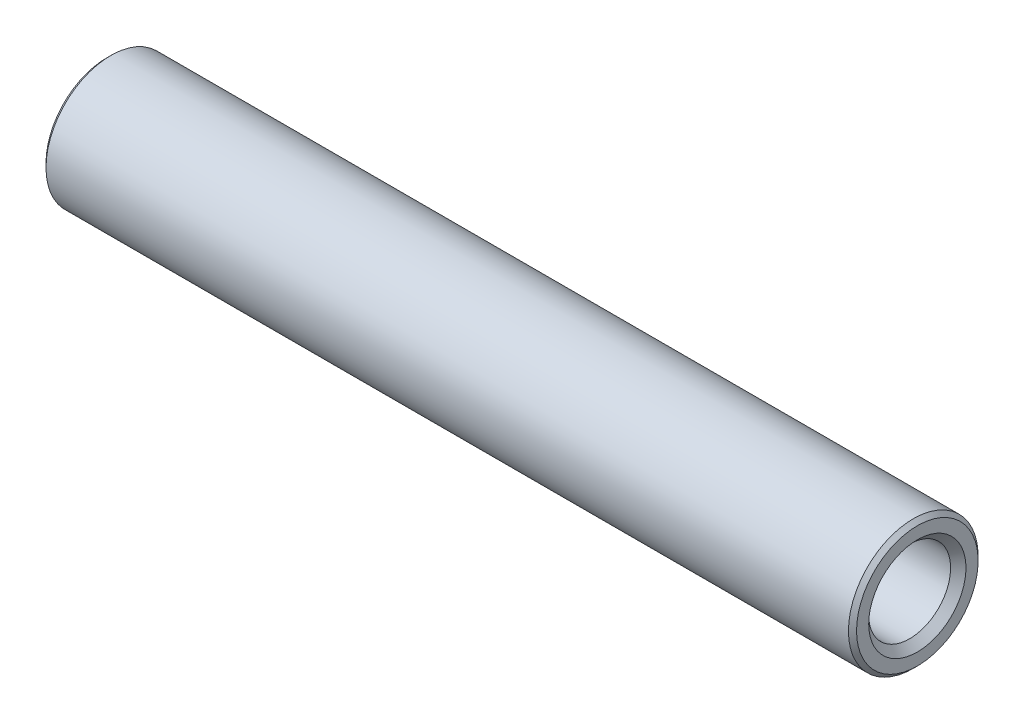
from build123d import *


with BuildPart() as part:
    # Sketch 1 → Revolve 1 (revolve)
    with BuildSketch(Plane.XY, mode=Mode.PRIVATE) as revolve_1_sk:
        Polygon((0, 7.5), (0, 5), (100, 5), (100, 7.5), (99.5, 8), (0.5, 8), align=None)
    revolve(revolve_1_sk.sketch.rotate(Axis((100, 0, 0), (-1, 0, 0)), 270), axis=Axis((100, 0, 0), (-1, 0, 0)))

    # Sketch 2 → Cut-Revolve 1 (revolve, cut)
    with BuildSketch(Plane.XY, mode=Mode.PRIVATE) as cut_revolve_1_sk:
        Polygon((0, 0), (0, 6), (0.947, 5.053), (27.08264909, 5.053), (30, 0), align=None)
    revolve(cut_revolve_1_sk.sketch.rotate(Axis((30, 0, 0), (-1, 0, 0)), 270), axis=Axis((30, 0, 0), (-1, 0, 0)), mode=Mode.SUBTRACT)

    # Sketch 3 → Cut-Revolve 2 (revolve, cut)
    with BuildSketch(Plane.XY, mode=Mode.PRIVATE) as cut_revolve_2_sk:
        Polygon((70, 0), (72.91735091, 5.053), (99.053, 5.053), (100, 6), (100, 0), align=None)
    revolve(cut_revolve_2_sk.sketch.rotate(Axis((100, 0, 0), (-1, 0, 0)), 270), axis=Axis((100, 0, 0), (-1, 0, 0)), mode=Mode.SUBTRACT)


solid = part.part
